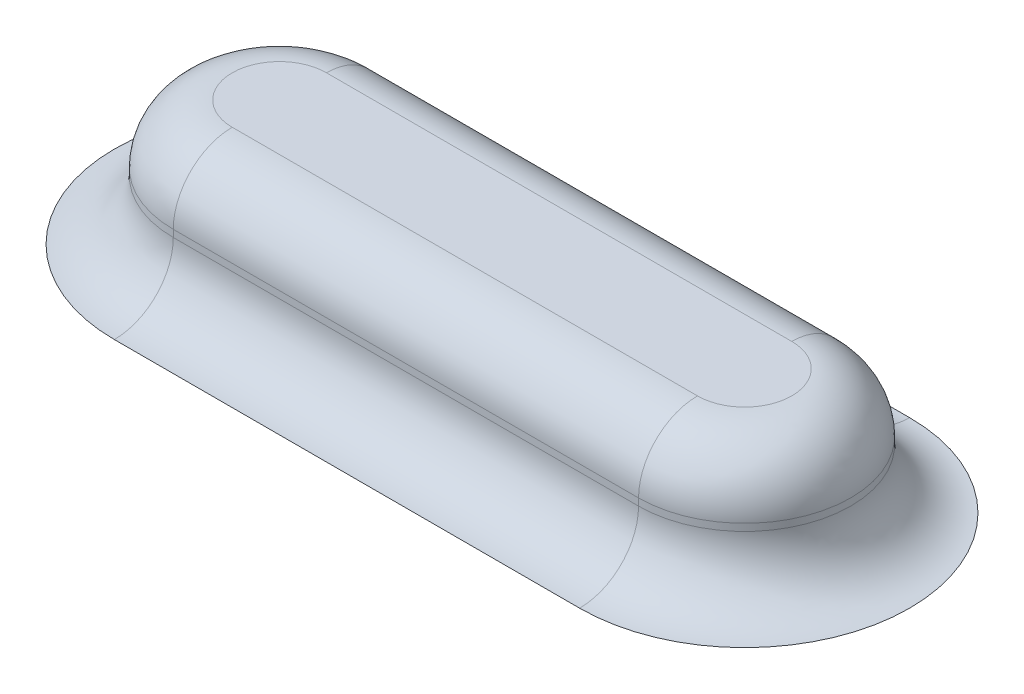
ISO-10303-21;
HEADER;
FILE_DESCRIPTION(('STEP AP214'),'2;1');
FILE_NAME('part.step','',(''),(''),'','','');
FILE_SCHEMA(('AUTOMOTIVE_DESIGN { 1 0 10303 214 1 1 1 1 }'));
ENDSEC;
DATA;
#1=APPLICATION_CONTEXT('core data for automotive mechanical design processes');
#2=APPLICATION_PROTOCOL_DEFINITION('international standard','automotive_design',2000,#1);
#3=PRODUCT_CONTEXT('',#1,'mechanical');
#4=PRODUCT('Part','Part','',(#3));
#5=PRODUCT_RELATED_PRODUCT_CATEGORY('part','',(#4));
#6=PRODUCT_DEFINITION_FORMATION('','',#4);
#7=PRODUCT_DEFINITION_CONTEXT('part definition',#1,'design');
#8=PRODUCT_DEFINITION('design','',#6,#7);
#9=PRODUCT_DEFINITION_SHAPE('','',#8);
#10=(LENGTH_UNIT() NAMED_UNIT(*) SI_UNIT(.MILLI.,.METRE.));
#11=(NAMED_UNIT(*) PLANE_ANGLE_UNIT() SI_UNIT($,.RADIAN.));
#12=(NAMED_UNIT(*) SI_UNIT($,.STERADIAN.) SOLID_ANGLE_UNIT());
#13=UNCERTAINTY_MEASURE_WITH_UNIT(LENGTH_MEASURE(1.E-05),#10,'distance_accuracy_value','');
#14=(GEOMETRIC_REPRESENTATION_CONTEXT(3) GLOBAL_UNCERTAINTY_ASSIGNED_CONTEXT((#13)) GLOBAL_UNIT_ASSIGNED_CONTEXT((#10,
#11,#12)) REPRESENTATION_CONTEXT('',''));
#15=CARTESIAN_POINT('',(0.,0.,0.));
#16=DIRECTION('',(0.,0.,1.));
#17=DIRECTION('',(1.,0.,0.));
#18=AXIS2_PLACEMENT_3D('',#15,#16,#17);
#19=CARTESIAN_POINT('',(-63.8058547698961,53.848,-23.9386818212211));
#20=DIRECTION('',(0.,-1.,0.));
#21=DIRECTION('',(0.,0.,-1.));
#22=AXIS2_PLACEMENT_3D('',#19,#20,#21);
#23=CYLINDRICAL_SURFACE('',#22,22.86);
#24=DIRECTION('',(0.,-1.,0.));
#25=VECTOR('',#24,1.);
#26=CARTESIAN_POINT('',(-63.8058547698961,53.848,-46.7986818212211));
#27=LINE('',#26,#25);
#28=CARTESIAN_POINT('',(-63.8058547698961,41.148,-46.7986818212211));
#29=VERTEX_POINT('',#28);
#30=CARTESIAN_POINT('',(-63.8058547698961,39.624,-46.7986818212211));
#31=VERTEX_POINT('',#30);
#32=EDGE_CURVE('E146',#29,#31,#27,.T.);
#33=ORIENTED_EDGE('',*,*,#32,.T.);
#34=CARTESIAN_POINT('',(-63.8058547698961,39.624,-23.9386818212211));
#35=DIRECTION('',(0.,1.,0.));
#36=DIRECTION('',(0.,0.,1.));
#37=AXIS2_PLACEMENT_3D('',#34,#35,#36);
#38=CIRCLE('',#37,22.86);
#39=CARTESIAN_POINT('',(-63.8058547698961,39.624,-1.07868182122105));
#40=VERTEX_POINT('',#39);
#41=EDGE_CURVE('E11',#31,#40,#38,.T.);
#42=ORIENTED_EDGE('',*,*,#41,.T.);
#43=DIRECTION('',(0.,-1.,0.));
#44=VECTOR('',#43,1.);
#45=CARTESIAN_POINT('',(-63.8058547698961,53.848,-1.07868182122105));
#46=LINE('',#45,#44);
#47=CARTESIAN_POINT('',(-63.8058547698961,41.148,-1.07868182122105));
#48=VERTEX_POINT('',#47);
#49=EDGE_CURVE('E168',#48,#40,#46,.T.);
#50=ORIENTED_EDGE('',*,*,#49,.F.);
#51=CARTESIAN_POINT('',(-63.8058547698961,41.148,-23.9386818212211));
#52=DIRECTION('',(0.,-1.,0.));
#53=DIRECTION('',(0.,0.,-1.));
#54=AXIS2_PLACEMENT_3D('',#51,#52,#53);
#55=CIRCLE('',#54,22.86);
#56=EDGE_CURVE('E40',#48,#29,#55,.T.);
#57=ORIENTED_EDGE('',*,*,#56,.T.);
#58=EDGE_LOOP('',(#33,#42,#50,#57));
#59=FACE_BOUND('',#58,.T.);
#60=ADVANCED_FACE('F31',(#59),#23,.T.);
#61=CARTESIAN_POINT('',(-63.8058547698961,53.848,-1.07868182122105));
#62=DIRECTION('',(0.,0.,-1.));
#63=DIRECTION('',(-1.,0.,0.));
#64=AXIS2_PLACEMENT_3D('',#61,#62,#63);
#65=PLANE('',#64);
#66=ORIENTED_EDGE('',*,*,#49,.T.);
#67=DIRECTION('',(1.,0.,0.));
#68=VECTOR('',#67,1.);
#69=CARTESIAN_POINT('',(-63.8058547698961,39.624,-1.07868182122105));
#70=LINE('',#69,#68);
#71=CARTESIAN_POINT('',(36.4612025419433,39.624,-1.07868182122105));
#72=VERTEX_POINT('',#71);
#73=EDGE_CURVE('E133',#40,#72,#70,.T.);
#74=ORIENTED_EDGE('',*,*,#73,.T.);
#75=DIRECTION('',(0.,-1.,0.));
#76=VECTOR('',#75,1.);
#77=CARTESIAN_POINT('',(36.4612025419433,53.848,-1.07868182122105));
#78=LINE('',#77,#76);
#79=CARTESIAN_POINT('',(36.4612025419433,41.148,-1.07868182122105));
#80=VERTEX_POINT('',#79);
#81=EDGE_CURVE('E171',#80,#72,#78,.T.);
#82=ORIENTED_EDGE('',*,*,#81,.F.);
#83=DIRECTION('',(1.,0.,0.));
#84=VECTOR('',#83,1.);
#85=CARTESIAN_POINT('',(-63.8058547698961,41.148,-1.07868182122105));
#86=LINE('',#85,#84);
#87=EDGE_CURVE('E131',#80,#48,#86,.F.);
#88=ORIENTED_EDGE('',*,*,#87,.T.);
#89=EDGE_LOOP('',(#66,#74,#82,#88));
#90=FACE_BOUND('',#89,.T.);
#91=ADVANCED_FACE('F167',(#90),#65,.F.);
#92=CARTESIAN_POINT('',(36.4612025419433,53.848,-23.9386818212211));
#93=DIRECTION('',(0.,-1.,0.));
#94=DIRECTION('',(0.,0.,-1.));
#95=AXIS2_PLACEMENT_3D('',#92,#93,#94);
#96=CYLINDRICAL_SURFACE('',#95,22.86);
#97=ORIENTED_EDGE('',*,*,#81,.T.);
#98=CARTESIAN_POINT('',(36.4612025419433,39.624,-23.9386818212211));
#99=DIRECTION('',(0.,1.,0.));
#100=DIRECTION('',(0.,0.,1.));
#101=AXIS2_PLACEMENT_3D('',#98,#99,#100);
#102=CIRCLE('',#101,22.86);
#103=CARTESIAN_POINT('',(36.4612025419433,39.624,-46.7986818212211));
#104=VERTEX_POINT('',#103);
#105=EDGE_CURVE('E129',#72,#104,#102,.T.);
#106=ORIENTED_EDGE('',*,*,#105,.T.);
#107=DIRECTION('',(0.,-1.,0.));
#108=VECTOR('',#107,1.);
#109=CARTESIAN_POINT('',(36.4612025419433,53.848,-46.7986818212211));
#110=LINE('',#109,#108);
#111=CARTESIAN_POINT('',(36.4612025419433,41.148,-46.7986818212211));
#112=VERTEX_POINT('',#111);
#113=EDGE_CURVE('E179',#112,#104,#110,.T.);
#114=ORIENTED_EDGE('',*,*,#113,.F.);
#115=CARTESIAN_POINT('',(36.4612025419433,41.148,-23.9386818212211));
#116=DIRECTION('',(0.,-1.,0.));
#117=DIRECTION('',(0.,0.,-1.));
#118=AXIS2_PLACEMENT_3D('',#115,#116,#117);
#119=CIRCLE('',#118,22.86);
#120=EDGE_CURVE('E106',#112,#80,#119,.T.);
#121=ORIENTED_EDGE('',*,*,#120,.T.);
#122=EDGE_LOOP('',(#97,#106,#114,#121));
#123=FACE_BOUND('',#122,.T.);
#124=ADVANCED_FACE('F190',(#123),#96,.T.);
#125=CARTESIAN_POINT('',(-63.8058547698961,53.848,-46.7986818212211));
#126=DIRECTION('',(0.,0.,1.));
#127=DIRECTION('',(1.,0.,0.));
#128=AXIS2_PLACEMENT_3D('',#125,#126,#127);
#129=PLANE('',#128);
#130=ORIENTED_EDGE('',*,*,#113,.T.);
#131=DIRECTION('',(-1.,0.,0.));
#132=VECTOR('',#131,1.);
#133=CARTESIAN_POINT('',(-63.8058547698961,39.624,-46.7986818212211));
#134=LINE('',#133,#132);
#135=EDGE_CURVE('E113',#104,#31,#134,.T.);
#136=ORIENTED_EDGE('',*,*,#135,.T.);
#137=ORIENTED_EDGE('',*,*,#32,.F.);
#138=DIRECTION('',(-1.,0.,0.));
#139=VECTOR('',#138,1.);
#140=CARTESIAN_POINT('',(-63.8058547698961,41.148,-46.7986818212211));
#141=LINE('',#140,#139);
#142=EDGE_CURVE('E176',#29,#112,#141,.F.);
#143=ORIENTED_EDGE('',*,*,#142,.T.);
#144=EDGE_LOOP('',(#130,#136,#137,#143));
#145=FACE_BOUND('',#144,.T.);
#146=ADVANCED_FACE('F185',(#145),#129,.F.);
#147=CARTESIAN_POINT('',(-63.8058547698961,53.848,-23.9386818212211));
#148=DIRECTION('',(0.,-1.,0.));
#149=DIRECTION('',(0.,0.,-1.));
#150=AXIS2_PLACEMENT_3D('',#147,#148,#149);
#151=PLANE('',#150);
#152=CARTESIAN_POINT('',(36.4612025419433,53.848,-23.9386818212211));
#153=DIRECTION('',(0.,-1.,0.));
#154=DIRECTION('',(0.,0.,-1.));
#155=AXIS2_PLACEMENT_3D('',#152,#153,#154);
#156=CIRCLE('',#155,10.16);
#157=CARTESIAN_POINT('',(36.4612025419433,53.848,-13.7786818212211));
#158=VERTEX_POINT('',#157);
#159=CARTESIAN_POINT('',(36.4612025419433,53.848,-34.0986818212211));
#160=VERTEX_POINT('',#159);
#161=EDGE_CURVE('E48',#158,#160,#156,.F.);
#162=ORIENTED_EDGE('',*,*,#161,.T.);
#163=DIRECTION('',(-1.,0.,0.));
#164=VECTOR('',#163,1.);
#165=CARTESIAN_POINT('',(-63.8058547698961,53.848,-34.0986818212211));
#166=LINE('',#165,#164);
#167=CARTESIAN_POINT('',(-63.8058547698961,53.848,-34.0986818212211));
#168=VERTEX_POINT('',#167);
#169=EDGE_CURVE('E139',#160,#168,#166,.T.);
#170=ORIENTED_EDGE('',*,*,#169,.T.);
#171=CARTESIAN_POINT('',(-63.8058547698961,53.848,-23.9386818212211));
#172=DIRECTION('',(0.,-1.,0.));
#173=DIRECTION('',(0.,0.,-1.));
#174=AXIS2_PLACEMENT_3D('',#171,#172,#173);
#175=CIRCLE('',#174,10.16);
#176=CARTESIAN_POINT('',(-63.8058547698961,53.848,-13.7786818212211));
#177=VERTEX_POINT('',#176);
#178=EDGE_CURVE('E135',#168,#177,#175,.F.);
#179=ORIENTED_EDGE('',*,*,#178,.T.);
#180=DIRECTION('',(1.,0.,0.));
#181=VECTOR('',#180,1.);
#182=CARTESIAN_POINT('',(-63.8058547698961,53.848,-13.7786818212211));
#183=LINE('',#182,#181);
#184=EDGE_CURVE('E53',#177,#158,#183,.T.);
#185=ORIENTED_EDGE('',*,*,#184,.T.);
#186=EDGE_LOOP('',(#162,#170,#179,#185));
#187=FACE_BOUND('',#186,.T.);
#188=ADVANCED_FACE('F215',(#187),#151,.F.);
#189=CARTESIAN_POINT('',(-63.8058547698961,39.624,11.6213181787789));
#190=DIRECTION('',(1.,0.,0.));
#191=DIRECTION('',(0.,0.,-1.));
#192=AXIS2_PLACEMENT_3D('',#189,#190,#191);
#193=CYLINDRICAL_SURFACE('',#192,12.7);
#194=CARTESIAN_POINT('',(-63.8058547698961,39.624,11.6213181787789));
#195=DIRECTION('',(1.,0.,0.));
#196=DIRECTION('',(0.,0.,-1.));
#197=AXIS2_PLACEMENT_3D('',#194,#195,#196);
#198=CIRCLE('',#197,12.7);
#199=CARTESIAN_POINT('',(-63.8058547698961,26.924,11.6213181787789));
#200=VERTEX_POINT('',#199);
#201=EDGE_CURVE('E116',#200,#40,#198,.T.);
#202=ORIENTED_EDGE('',*,*,#201,.F.);
#203=DIRECTION('',(1.,0.,0.));
#204=VECTOR('',#203,1.);
#205=CARTESIAN_POINT('',(-114.040460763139,26.924,11.6213181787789));
#206=LINE('',#205,#204);
#207=CARTESIAN_POINT('',(36.4612025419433,26.924,11.6213181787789));
#208=VERTEX_POINT('',#207);
#209=EDGE_CURVE('E123',#208,#200,#206,.F.);
#210=ORIENTED_EDGE('',*,*,#209,.F.);
#211=CARTESIAN_POINT('',(36.4612025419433,39.624,11.6213181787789));
#212=DIRECTION('',(-1.,0.,0.));
#213=DIRECTION('',(0.,0.,1.));
#214=AXIS2_PLACEMENT_3D('',#211,#212,#213);
#215=CIRCLE('',#214,12.7);
#216=EDGE_CURVE('E122',#72,#208,#215,.T.);
#217=ORIENTED_EDGE('',*,*,#216,.F.);
#218=ORIENTED_EDGE('',*,*,#73,.F.);
#219=EDGE_LOOP('',(#202,#210,#217,#218));
#220=FACE_BOUND('',#219,.T.);
#221=ADVANCED_FACE('F193',(#220),#193,.F.);
#222=CARTESIAN_POINT('',(36.4612025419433,39.624,-23.9386818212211));
#223=DIRECTION('',(0.,1.,0.));
#224=DIRECTION('',(0.,0.,1.));
#225=AXIS2_PLACEMENT_3D('',#222,#223,#224);
#226=TOROIDAL_SURFACE('',#225,35.56,12.7);
#227=ORIENTED_EDGE('',*,*,#216,.T.);
#228=CARTESIAN_POINT('',(36.4612025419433,26.924,-23.9386818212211));
#229=DIRECTION('',(0.,1.,0.));
#230=DIRECTION('',(0.,0.,1.));
#231=AXIS2_PLACEMENT_3D('',#228,#229,#230);
#232=CIRCLE('',#231,35.56);
#233=CARTESIAN_POINT('',(36.4612025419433,26.924,-59.498681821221));
#234=VERTEX_POINT('',#233);
#235=EDGE_CURVE('E100',#234,#208,#232,.F.);
#236=ORIENTED_EDGE('',*,*,#235,.F.);
#237=CARTESIAN_POINT('',(36.4612025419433,39.624,-59.498681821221));
#238=DIRECTION('',(1.,0.,0.));
#239=DIRECTION('',(0.,0.,-1.));
#240=AXIS2_PLACEMENT_3D('',#237,#238,#239);
#241=CIRCLE('',#240,12.7);
#242=EDGE_CURVE('E110',#104,#234,#241,.T.);
#243=ORIENTED_EDGE('',*,*,#242,.F.);
#244=ORIENTED_EDGE('',*,*,#105,.F.);
#245=EDGE_LOOP('',(#227,#236,#243,#244));
#246=FACE_BOUND('',#245,.T.);
#247=ADVANCED_FACE('F120',(#246),#226,.F.);
#248=CARTESIAN_POINT('',(-63.8058547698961,39.624,-23.9386818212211));
#249=DIRECTION('',(0.,1.,0.));
#250=DIRECTION('',(0.,0.,1.));
#251=AXIS2_PLACEMENT_3D('',#248,#249,#250);
#252=TOROIDAL_SURFACE('',#251,35.56,12.7);
#253=ORIENTED_EDGE('',*,*,#201,.T.);
#254=ORIENTED_EDGE('',*,*,#41,.F.);
#255=CARTESIAN_POINT('',(-63.8058547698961,39.624,-59.498681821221));
#256=DIRECTION('',(-1.,0.,0.));
#257=DIRECTION('',(0.,0.,1.));
#258=AXIS2_PLACEMENT_3D('',#255,#256,#257);
#259=CIRCLE('',#258,12.7);
#260=CARTESIAN_POINT('',(-63.8058547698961,26.924,-59.498681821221));
#261=VERTEX_POINT('',#260);
#262=EDGE_CURVE('E117',#261,#31,#259,.T.);
#263=ORIENTED_EDGE('',*,*,#262,.F.);
#264=CARTESIAN_POINT('',(-63.8058547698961,26.924,-23.9386818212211));
#265=DIRECTION('',(0.,1.,0.));
#266=DIRECTION('',(0.,0.,1.));
#267=AXIS2_PLACEMENT_3D('',#264,#265,#266);
#268=CIRCLE('',#267,35.56);
#269=EDGE_CURVE('E103',#200,#261,#268,.F.);
#270=ORIENTED_EDGE('',*,*,#269,.F.);
#271=EDGE_LOOP('',(#253,#254,#263,#270));
#272=FACE_BOUND('',#271,.T.);
#273=ADVANCED_FACE('F195',(#272),#252,.F.);
#274=CARTESIAN_POINT('',(-63.8058547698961,39.624,-59.498681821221));
#275=DIRECTION('',(-1.,0.,0.));
#276=DIRECTION('',(0.,0.,1.));
#277=AXIS2_PLACEMENT_3D('',#274,#275,#276);
#278=CYLINDRICAL_SURFACE('',#277,12.7);
#279=ORIENTED_EDGE('',*,*,#242,.T.);
#280=DIRECTION('',(-1.,0.,0.));
#281=VECTOR('',#280,1.);
#282=CARTESIAN_POINT('',(-114.040460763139,26.924,-59.498681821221));
#283=LINE('',#282,#281);
#284=EDGE_CURVE('E96',#261,#234,#283,.F.);
#285=ORIENTED_EDGE('',*,*,#284,.F.);
#286=ORIENTED_EDGE('',*,*,#262,.T.);
#287=ORIENTED_EDGE('',*,*,#135,.F.);
#288=EDGE_LOOP('',(#279,#285,#286,#287));
#289=FACE_BOUND('',#288,.T.);
#290=ADVANCED_FACE('F111',(#289),#278,.F.);
#291=CARTESIAN_POINT('',(-63.8058547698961,41.148,-13.7786818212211));
#292=DIRECTION('',(1.,0.,0.));
#293=DIRECTION('',(0.,0.,-1.));
#294=AXIS2_PLACEMENT_3D('',#291,#292,#293);
#295=CYLINDRICAL_SURFACE('',#294,12.7);
#296=CARTESIAN_POINT('',(-63.8058547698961,41.148,-13.7786818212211));
#297=DIRECTION('',(-1.,0.,0.));
#298=DIRECTION('',(0.,0.,1.));
#299=AXIS2_PLACEMENT_3D('',#296,#297,#298);
#300=CIRCLE('',#299,12.7);
#301=EDGE_CURVE('E150',#48,#177,#300,.T.);
#302=ORIENTED_EDGE('',*,*,#301,.F.);
#303=ORIENTED_EDGE('',*,*,#87,.F.);
#304=CARTESIAN_POINT('',(36.4612025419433,41.148,-13.7786818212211));
#305=DIRECTION('',(1.,0.,0.));
#306=DIRECTION('',(0.,0.,-1.));
#307=AXIS2_PLACEMENT_3D('',#304,#305,#306);
#308=CIRCLE('',#307,12.7);
#309=EDGE_CURVE('E35',#158,#80,#308,.T.);
#310=ORIENTED_EDGE('',*,*,#309,.F.);
#311=ORIENTED_EDGE('',*,*,#184,.F.);
#312=EDGE_LOOP('',(#302,#303,#310,#311));
#313=FACE_BOUND('',#312,.T.);
#314=ADVANCED_FACE('F33',(#313),#295,.T.);
#315=CARTESIAN_POINT('',(36.4612025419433,41.148,-23.9386818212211));
#316=DIRECTION('',(0.,-1.,0.));
#317=DIRECTION('',(0.,0.,-1.));
#318=AXIS2_PLACEMENT_3D('',#315,#316,#317);
#319=DEGENERATE_TOROIDAL_SURFACE('',#318,10.16,12.7,.T.);
#320=ORIENTED_EDGE('',*,*,#309,.T.);
#321=ORIENTED_EDGE('',*,*,#120,.F.);
#322=CARTESIAN_POINT('',(36.4612025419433,41.148,-34.0986818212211));
#323=DIRECTION('',(-1.,0.,0.));
#324=DIRECTION('',(0.,0.,1.));
#325=AXIS2_PLACEMENT_3D('',#322,#323,#324);
#326=CIRCLE('',#325,12.7);
#327=EDGE_CURVE('E149',#160,#112,#326,.T.);
#328=ORIENTED_EDGE('',*,*,#327,.F.);
#329=ORIENTED_EDGE('',*,*,#161,.F.);
#330=EDGE_LOOP('',(#320,#321,#328,#329));
#331=FACE_BOUND('',#330,.T.);
#332=ADVANCED_FACE('F159',(#331),#319,.T.);
#333=CARTESIAN_POINT('',(-63.8058547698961,41.148,-23.9386818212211));
#334=DIRECTION('',(0.,-1.,0.));
#335=DIRECTION('',(0.,0.,-1.));
#336=AXIS2_PLACEMENT_3D('',#333,#334,#335);
#337=DEGENERATE_TOROIDAL_SURFACE('',#336,10.16,12.7,.T.);
#338=ORIENTED_EDGE('',*,*,#301,.T.);
#339=ORIENTED_EDGE('',*,*,#178,.F.);
#340=CARTESIAN_POINT('',(-63.8058547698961,41.148,-34.0986818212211));
#341=DIRECTION('',(1.,0.,0.));
#342=DIRECTION('',(0.,0.,-1.));
#343=AXIS2_PLACEMENT_3D('',#340,#341,#342);
#344=CIRCLE('',#343,12.7);
#345=EDGE_CURVE('E147',#29,#168,#344,.T.);
#346=ORIENTED_EDGE('',*,*,#345,.F.);
#347=ORIENTED_EDGE('',*,*,#56,.F.);
#348=EDGE_LOOP('',(#338,#339,#346,#347));
#349=FACE_BOUND('',#348,.T.);
#350=ADVANCED_FACE('F223',(#349),#337,.T.);
#351=CARTESIAN_POINT('',(-63.8058547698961,41.148,-34.0986818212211));
#352=DIRECTION('',(-1.,0.,0.));
#353=DIRECTION('',(0.,0.,1.));
#354=AXIS2_PLACEMENT_3D('',#351,#352,#353);
#355=CYLINDRICAL_SURFACE('',#354,12.7);
#356=ORIENTED_EDGE('',*,*,#327,.T.);
#357=ORIENTED_EDGE('',*,*,#142,.F.);
#358=ORIENTED_EDGE('',*,*,#345,.T.);
#359=ORIENTED_EDGE('',*,*,#169,.F.);
#360=EDGE_LOOP('',(#356,#357,#358,#359));
#361=FACE_BOUND('',#360,.T.);
#362=ADVANCED_FACE('F219',(#361),#355,.T.);
#363=CARTESIAN_POINT('',(-114.040460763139,26.924,-85.2100071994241));
#364=DIRECTION('',(0.,1.,0.));
#365=DIRECTION('',(0.,0.,1.));
#366=AXIS2_PLACEMENT_3D('',#363,#364,#365);
#367=PLANE('',#366);
#368=ORIENTED_EDGE('',*,*,#209,.T.);
#369=ORIENTED_EDGE('',*,*,#269,.T.);
#370=ORIENTED_EDGE('',*,*,#284,.T.);
#371=ORIENTED_EDGE('',*,*,#235,.T.);
#372=EDGE_LOOP('',(#368,#369,#370,#371));
#373=FACE_BOUND('',#372,.T.);
#374=ADVANCED_FACE('F98',(#373),#367,.F.);
#375=CLOSED_SHELL('',(#60,#91,#124,#146,#188,#221,#247,#273,#290,#314,#332,#350,#362,#374));
#376=MANIFOLD_SOLID_BREP('B2',#375);
#377=ADVANCED_BREP_SHAPE_REPRESENTATION('',(#18,#376),#14);
#378=SHAPE_DEFINITION_REPRESENTATION(#9,#377);
ENDSEC;
END-ISO-10303-21;
